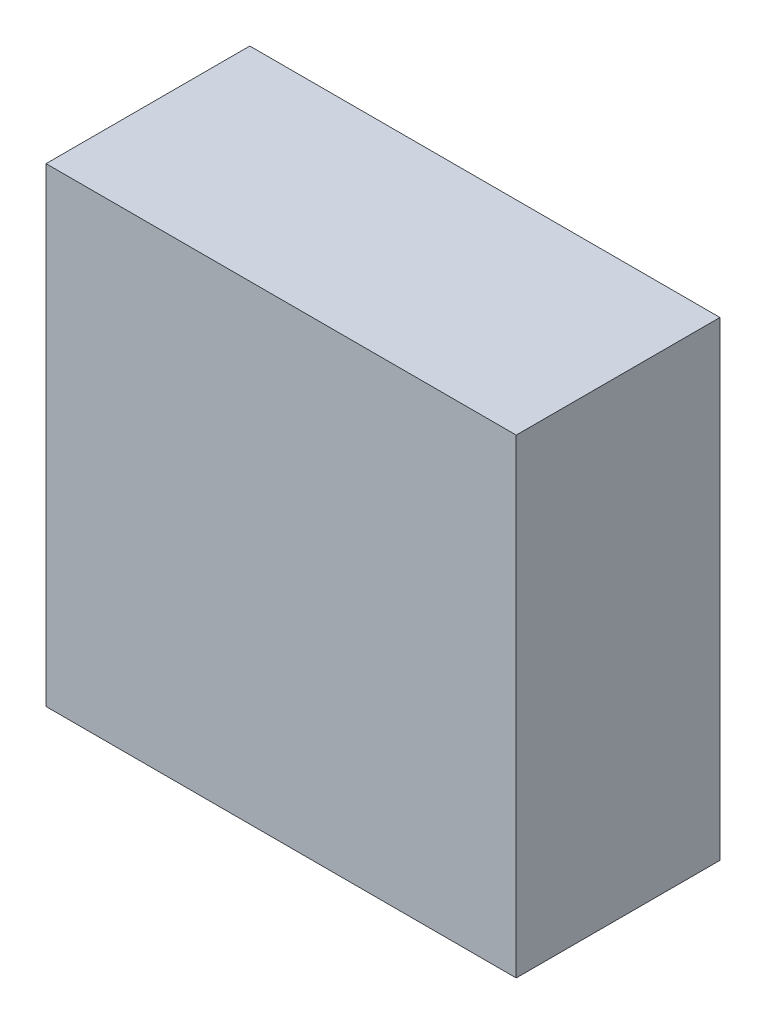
from build123d import *

# Parameters (mm, degrees)
SKETCH_1_W      = 3
SKETCH_1_H      = 3
EXTRUDE_1_DEPTH = 1.3


with BuildPart() as part:
    # Sketch 1 → Extrude 1 (new body)
    with BuildSketch(Plane.XY):
        Rectangle(SKETCH_1_W, SKETCH_1_H)
    extrude(amount=EXTRUDE_1_DEPTH)


solid = part.part
